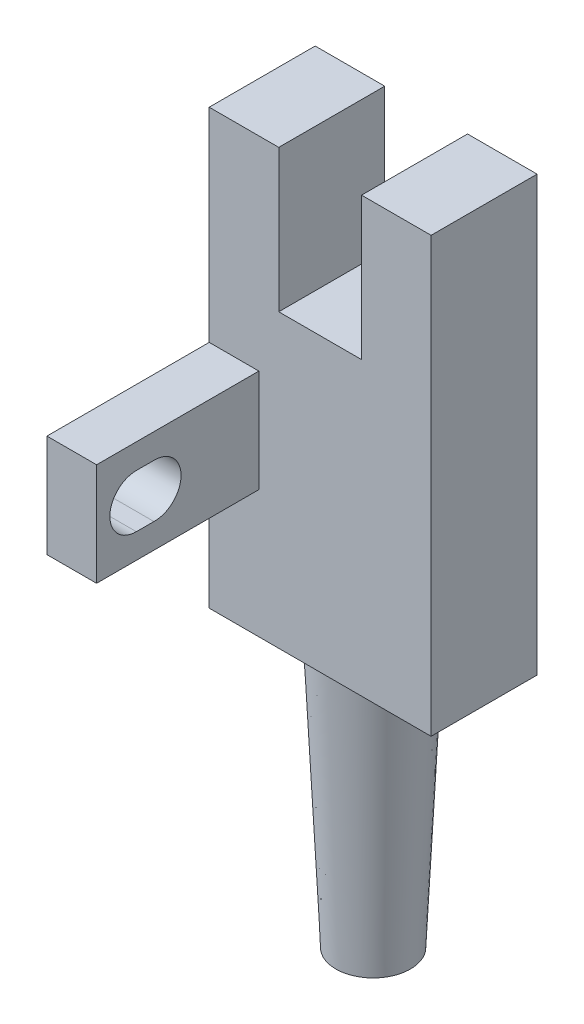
ISO-10303-21;
HEADER;
FILE_DESCRIPTION(('STEP AP214'),'2;1');
FILE_NAME('part.step','',(''),(''),'','','');
FILE_SCHEMA(('AUTOMOTIVE_DESIGN { 1 0 10303 214 1 1 1 1 }'));
ENDSEC;
DATA;
#1=APPLICATION_CONTEXT('core data for automotive mechanical design processes');
#2=APPLICATION_PROTOCOL_DEFINITION('international standard','automotive_design',2000,#1);
#3=PRODUCT_CONTEXT('',#1,'mechanical');
#4=PRODUCT('Part','Part','',(#3));
#5=PRODUCT_RELATED_PRODUCT_CATEGORY('part','',(#4));
#6=PRODUCT_DEFINITION_FORMATION('','',#4);
#7=PRODUCT_DEFINITION_CONTEXT('part definition',#1,'design');
#8=PRODUCT_DEFINITION('design','',#6,#7);
#9=PRODUCT_DEFINITION_SHAPE('','',#8);
#10=(LENGTH_UNIT() NAMED_UNIT(*) SI_UNIT(.MILLI.,.METRE.));
#11=(NAMED_UNIT(*) PLANE_ANGLE_UNIT() SI_UNIT($,.RADIAN.));
#12=(NAMED_UNIT(*) SI_UNIT($,.STERADIAN.) SOLID_ANGLE_UNIT());
#13=UNCERTAINTY_MEASURE_WITH_UNIT(LENGTH_MEASURE(1.E-05),#10,'distance_accuracy_value','');
#14=(GEOMETRIC_REPRESENTATION_CONTEXT(3) GLOBAL_UNCERTAINTY_ASSIGNED_CONTEXT((#13)) GLOBAL_UNIT_ASSIGNED_CONTEXT((#10,
#11,#12)) REPRESENTATION_CONTEXT('',''));
#15=CARTESIAN_POINT('',(0.,0.,0.));
#16=DIRECTION('',(0.,0.,1.));
#17=DIRECTION('',(1.,0.,0.));
#18=AXIS2_PLACEMENT_3D('',#15,#16,#17);
#19=CARTESIAN_POINT('',(60.923,6.200412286,141.22262812));
#20=DIRECTION('',(0.,1.,0.));
#21=DIRECTION('',(0.,0.,1.));
#22=AXIS2_PLACEMENT_3D('',#19,#20,#21);
#23=PLANE('',#22);
#24=CARTESIAN_POINT('',(63.2,6.20041228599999,143.49962812));
#25=DIRECTION('',(0.,1.,0.));
#26=DIRECTION('',(-1.,0.,0.));
#27=AXIS2_PLACEMENT_3D('',#24,#25,#26);
#28=CIRCLE('',#27,2.24999999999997);
#29=CARTESIAN_POINT('',(60.95,6.20041228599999,143.49962812));
#30=VERTEX_POINT('',#29);
#31=EDGE_CURVE('E21',#30,#30,#28,.F.);
#32=ORIENTED_EDGE('',*,*,#31,.T.);
#33=EDGE_LOOP('',(#32));
#34=FACE_BOUND('',#33,.T.);
#35=ADVANCED_FACE('F17',(#34),#23,.F.);
#36=CARTESIAN_POINT('',(63.2,6.200412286,143.49962812));
#37=DIRECTION('',(0.,1.,0.));
#38=DIRECTION('',(-1.,0.,0.));
#39=AXIS2_PLACEMENT_3D('',#36,#37,#38);
#40=CONICAL_SURFACE('',#39,2.24999999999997,0.0468407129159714);
#41=ORIENTED_EDGE('',*,*,#31,.F.);
#42=EDGE_LOOP('',(#41));
#43=FACE_BOUND('',#42,.T.);
#44=CARTESIAN_POINT('',(63.2,22.2004122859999,143.49962812));
#45=DIRECTION('',(0.,1.,0.));
#46=DIRECTION('',(-1.,0.,0.));
#47=AXIS2_PLACEMENT_3D('',#44,#45,#46);
#48=CIRCLE('',#47,3.);
#49=CARTESIAN_POINT('',(60.2,22.2004122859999,143.49962812));
#50=VERTEX_POINT('',#49);
#51=EDGE_CURVE('E205',#50,#50,#48,.F.);
#52=ORIENTED_EDGE('',*,*,#51,.T.);
#53=EDGE_LOOP('',(#52));
#54=FACE_BOUND('',#53,.T.);
#55=ADVANCED_FACE('F523',(#43,#54),#40,.T.);
#56=CARTESIAN_POINT('',(56.5,31.400412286,153.036320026));
#57=DIRECTION('',(0.,1.,0.));
#58=DIRECTION('',(0.,0.,1.));
#59=AXIS2_PLACEMENT_3D('',#56,#57,#58);
#60=PLANE('',#59);
#61=DIRECTION('',(-1.,0.,0.));
#62=VECTOR('',#61,1.);
#63=CARTESIAN_POINT('',(58.,31.4004122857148,153.036320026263));
#64=LINE('',#63,#62);
#65=CARTESIAN_POINT('',(56.5,31.4004122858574,153.036320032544));
#66=VERTEX_POINT('',#65);
#67=CARTESIAN_POINT('',(59.5,31.4004122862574,153.03632005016));
#68=VERTEX_POINT('',#67);
#69=EDGE_CURVE('E86',#66,#68,#64,.F.);
#70=ORIENTED_EDGE('',*,*,#69,.F.);
#71=DIRECTION('',(0.,0.,1.));
#72=VECTOR('',#71,1.);
#73=CARTESIAN_POINT('',(56.5,31.400412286,153.567974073));
#74=LINE('',#73,#72);
#75=CARTESIAN_POINT('',(56.5,31.400412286,154.099628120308));
#76=VERTEX_POINT('',#75);
#77=EDGE_CURVE('E179',#66,#76,#74,.T.);
#78=ORIENTED_EDGE('',*,*,#77,.T.);
#79=DIRECTION('',(1.,0.,0.));
#80=VECTOR('',#79,1.);
#81=CARTESIAN_POINT('',(58.,31.400412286,154.099628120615));
#82=LINE('',#81,#80);
#83=CARTESIAN_POINT('',(59.5,31.4004122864,154.099628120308));
#84=VERTEX_POINT('',#83);
#85=EDGE_CURVE('E204',#84,#76,#82,.F.);
#86=ORIENTED_EDGE('',*,*,#85,.F.);
#87=DIRECTION('',(0.,0.,1.));
#88=VECTOR('',#87,1.);
#89=CARTESIAN_POINT('',(59.5,31.4004122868,151.59962812));
#90=LINE('',#89,#88);
#91=EDGE_CURVE('E173',#68,#84,#90,.T.);
#92=ORIENTED_EDGE('',*,*,#91,.F.);
#93=EDGE_LOOP('',(#70,#78,#86,#92));
#94=FACE_BOUND('',#93,.T.);
#95=ADVANCED_FACE('F346',(#94),#60,.T.);
#96=CARTESIAN_POINT('',(56.5,34.6,153.));
#97=DIRECTION('',(0.,1.,0.));
#98=DIRECTION('',(0.,0.,1.));
#99=AXIS2_PLACEMENT_3D('',#96,#97,#98);
#100=PLANE('',#99);
#101=DIRECTION('',(1.,0.,0.));
#102=VECTOR('',#101,1.);
#103=CARTESIAN_POINT('',(58.,34.6,153.000000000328));
#104=LINE('',#103,#102);
#105=CARTESIAN_POINT('',(59.5,34.5999999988,153.000000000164));
#106=VERTEX_POINT('',#105);
#107=CARTESIAN_POINT('',(56.5,34.6,153.000000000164));
#108=VERTEX_POINT('',#107);
#109=EDGE_CURVE('E207',#106,#108,#104,.F.);
#110=ORIENTED_EDGE('',*,*,#109,.F.);
#111=DIRECTION('',(0.,0.,-1.));
#112=VECTOR('',#111,1.);
#113=CARTESIAN_POINT('',(59.5,34.5999999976,151.59962812));
#114=LINE('',#113,#112);
#115=CARTESIAN_POINT('',(59.5,34.5999999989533,154.063308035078));
#116=VERTEX_POINT('',#115);
#117=EDGE_CURVE('E175',#116,#106,#114,.T.);
#118=ORIENTED_EDGE('',*,*,#117,.F.);
#119=DIRECTION('',(-1.,0.,0.));
#120=VECTOR('',#119,1.);
#121=CARTESIAN_POINT('',(58.,34.6000000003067,154.06330809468));
#122=LINE('',#121,#120);
#123=CARTESIAN_POINT('',(56.5,34.6000000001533,154.063308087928));
#124=VERTEX_POINT('',#123);
#125=EDGE_CURVE('E203',#124,#116,#122,.F.);
#126=ORIENTED_EDGE('',*,*,#125,.F.);
#127=DIRECTION('',(0.,0.,1.));
#128=VECTOR('',#127,1.);
#129=CARTESIAN_POINT('',(56.5,34.6,153.531654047));
#130=LINE('',#129,#128);
#131=EDGE_CURVE('E177',#108,#124,#130,.T.);
#132=ORIENTED_EDGE('',*,*,#131,.F.);
#133=EDGE_LOOP('',(#110,#118,#126,#132));
#134=FACE_BOUND('',#133,.T.);
#135=ADVANCED_FACE('F343',(#134),#100,.F.);
#136=CARTESIAN_POINT('',(59.5,29.900412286,156.49962812));
#137=DIRECTION('',(1.,0.,0.));
#138=DIRECTION('',(0.,0.,-1.));
#139=AXIS2_PLACEMENT_3D('',#136,#137,#138);
#140=PLANE('',#139);
#141=CARTESIAN_POINT('',(59.5,33.,153.));
#142=DIRECTION('',(1.,0.,0.));
#143=DIRECTION('',(0.,0.,-1.));
#144=AXIS2_PLACEMENT_3D('',#141,#142,#143);
#145=CIRCLE('',#144,1.59999999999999);
#146=EDGE_CURVE('E91',#68,#106,#145,.T.);
#147=ORIENTED_EDGE('',*,*,#146,.F.);
#148=ORIENTED_EDGE('',*,*,#91,.T.);
#149=CARTESIAN_POINT('',(59.5,33.000412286,154.09962812));
#150=DIRECTION('',(1.,0.,0.));
#151=DIRECTION('',(0.,0.,-1.));
#152=AXIS2_PLACEMENT_3D('',#149,#150,#151);
#153=CIRCLE('',#152,1.59999999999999);
#154=EDGE_CURVE('E199',#116,#84,#153,.T.);
#155=ORIENTED_EDGE('',*,*,#154,.F.);
#156=ORIENTED_EDGE('',*,*,#117,.T.);
#157=EDGE_LOOP('',(#147,#148,#155,#156));
#158=FACE_BOUND('',#157,.T.);
#159=DIRECTION('',(0.,0.,-1.));
#160=VECTOR('',#159,1.);
#161=CARTESIAN_POINT('',(59.5,29.900412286,151.59962812));
#162=LINE('',#161,#160);
#163=CARTESIAN_POINT('',(59.5,29.900412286,156.49962812));
#164=VERTEX_POINT('',#163);
#165=CARTESIAN_POINT('',(59.49999999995,29.9004122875,146.69962812));
#166=VERTEX_POINT('',#165);
#167=EDGE_CURVE('E239',#164,#166,#162,.T.);
#168=ORIENTED_EDGE('',*,*,#167,.T.);
#169=DIRECTION('',(0.,-1.,0.));
#170=VECTOR('',#169,1.);
#171=CARTESIAN_POINT('',(59.4999999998,35.300412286,146.69962812));
#172=LINE('',#171,#170);
#173=CARTESIAN_POINT('',(59.49999999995,36.10041228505,146.69962812));
#174=VERTEX_POINT('',#173);
#175=EDGE_CURVE('E134',#174,#166,#172,.T.);
#176=ORIENTED_EDGE('',*,*,#175,.F.);
#177=DIRECTION('',(0.,0.,-1.));
#178=VECTOR('',#177,1.);
#179=CARTESIAN_POINT('',(59.5,36.100412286,151.59962812));
#180=LINE('',#179,#178);
#181=CARTESIAN_POINT('',(59.5,36.100412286,156.49962812));
#182=VERTEX_POINT('',#181);
#183=EDGE_CURVE('E132',#182,#174,#180,.T.);
#184=ORIENTED_EDGE('',*,*,#183,.F.);
#185=DIRECTION('',(0.,1.,0.));
#186=VECTOR('',#185,1.);
#187=CARTESIAN_POINT('',(59.5,33.000412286,156.49962812));
#188=LINE('',#187,#186);
#189=EDGE_CURVE('E129',#164,#182,#188,.T.);
#190=ORIENTED_EDGE('',*,*,#189,.F.);
#191=EDGE_LOOP('',(#168,#176,#184,#190));
#192=FACE_BOUND('',#191,.T.);
#193=ADVANCED_FACE('F133',(#158,#192),#140,.T.);
#194=CARTESIAN_POINT('',(69.9,22.200412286,146.69962812));
#195=DIRECTION('',(1.,0.,0.));
#196=DIRECTION('',(0.,0.,-1.));
#197=AXIS2_PLACEMENT_3D('',#194,#195,#196);
#198=PLANE('',#197);
#199=DIRECTION('',(0.,1.,0.));
#200=VECTOR('',#199,1.);
#201=CARTESIAN_POINT('',(69.9,35.300412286,140.29962812));
#202=LINE('',#201,#200);
#203=CARTESIAN_POINT('',(69.9,22.200412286,140.29962812));
#204=VERTEX_POINT('',#203);
#205=CARTESIAN_POINT('',(69.9,48.400412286,140.29962812));
#206=VERTEX_POINT('',#205);
#207=EDGE_CURVE('E315',#204,#206,#202,.T.);
#208=ORIENTED_EDGE('',*,*,#207,.T.);
#209=DIRECTION('',(0.,0.,-1.));
#210=VECTOR('',#209,1.);
#211=CARTESIAN_POINT('',(69.9,48.400412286,143.49962812));
#212=LINE('',#211,#210);
#213=CARTESIAN_POINT('',(69.9,48.400412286,146.69962812));
#214=VERTEX_POINT('',#213);
#215=EDGE_CURVE('E170',#214,#206,#212,.T.);
#216=ORIENTED_EDGE('',*,*,#215,.F.);
#217=DIRECTION('',(0.,1.,0.));
#218=VECTOR('',#217,1.);
#219=CARTESIAN_POINT('',(69.9,35.300412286,146.69962812));
#220=LINE('',#219,#218);
#221=CARTESIAN_POINT('',(69.9,22.200412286,146.69962812));
#222=VERTEX_POINT('',#221);
#223=EDGE_CURVE('E100',#222,#214,#220,.T.);
#224=ORIENTED_EDGE('',*,*,#223,.F.);
#225=DIRECTION('',(0.,0.,-1.));
#226=VECTOR('',#225,1.);
#227=CARTESIAN_POINT('',(69.9,22.200412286,143.49962812));
#228=LINE('',#227,#226);
#229=EDGE_CURVE('E208',#222,#204,#228,.T.);
#230=ORIENTED_EDGE('',*,*,#229,.T.);
#231=EDGE_LOOP('',(#208,#216,#224,#230));
#232=FACE_BOUND('',#231,.T.);
#233=ADVANCED_FACE('F413',(#232),#198,.T.);
#234=CARTESIAN_POINT('',(65.7,48.400412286,140.29962812));
#235=DIRECTION('',(0.,1.,0.));
#236=DIRECTION('',(0.,0.,1.));
#237=AXIS2_PLACEMENT_3D('',#234,#235,#236);
#238=PLANE('',#237);
#239=DIRECTION('',(-1.,0.,0.));
#240=VECTOR('',#239,1.);
#241=CARTESIAN_POINT('',(63.2,48.400412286,140.29962812));
#242=LINE('',#241,#240);
#243=CARTESIAN_POINT('',(65.6999999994,48.400412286,140.29962812));
#244=VERTEX_POINT('',#243);
#245=EDGE_CURVE('E312',#206,#244,#242,.T.);
#246=ORIENTED_EDGE('',*,*,#245,.T.);
#247=DIRECTION('',(0.,0.,1.));
#248=VECTOR('',#247,1.);
#249=CARTESIAN_POINT('',(65.7,48.400412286,143.49962812));
#250=LINE('',#249,#248);
#251=CARTESIAN_POINT('',(65.6999999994,48.400412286,146.69962812));
#252=VERTEX_POINT('',#251);
#253=EDGE_CURVE('E167',#244,#252,#250,.T.);
#254=ORIENTED_EDGE('',*,*,#253,.T.);
#255=DIRECTION('',(-1.,0.,0.));
#256=VECTOR('',#255,1.);
#257=CARTESIAN_POINT('',(63.2,48.400412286,146.69962812));
#258=LINE('',#257,#256);
#259=EDGE_CURVE('E227',#214,#252,#258,.T.);
#260=ORIENTED_EDGE('',*,*,#259,.F.);
#261=ORIENTED_EDGE('',*,*,#215,.T.);
#262=EDGE_LOOP('',(#246,#254,#260,#261));
#263=FACE_BOUND('',#262,.T.);
#264=ADVANCED_FACE('F417',(#263),#238,.T.);
#265=CARTESIAN_POINT('',(65.7,39.800412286,146.69962812));
#266=DIRECTION('',(1.,0.,0.));
#267=DIRECTION('',(0.,0.,-1.));
#268=AXIS2_PLACEMENT_3D('',#265,#266,#267);
#269=PLANE('',#268);
#270=DIRECTION('',(0.,-1.,0.));
#271=VECTOR('',#270,1.);
#272=CARTESIAN_POINT('',(65.6999999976,35.300412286,146.69962812));
#273=LINE('',#272,#271);
#274=CARTESIAN_POINT('',(65.6999999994,39.80041228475,146.69962812));
#275=VERTEX_POINT('',#274);
#276=EDGE_CURVE('E225',#252,#275,#273,.T.);
#277=ORIENTED_EDGE('',*,*,#276,.F.);
#278=ORIENTED_EDGE('',*,*,#253,.F.);
#279=DIRECTION('',(0.,-1.,0.));
#280=VECTOR('',#279,1.);
#281=CARTESIAN_POINT('',(65.6999999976,35.300412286,140.29962812));
#282=LINE('',#281,#280);
#283=CARTESIAN_POINT('',(65.6999999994,39.80041228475,140.29962812));
#284=VERTEX_POINT('',#283);
#285=EDGE_CURVE('E309',#244,#284,#282,.T.);
#286=ORIENTED_EDGE('',*,*,#285,.T.);
#287=DIRECTION('',(0.,0.,-1.));
#288=VECTOR('',#287,1.);
#289=CARTESIAN_POINT('',(65.7,39.800412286,143.49962812));
#290=LINE('',#289,#288);
#291=EDGE_CURVE('E164',#275,#284,#290,.T.);
#292=ORIENTED_EDGE('',*,*,#291,.F.);
#293=EDGE_LOOP('',(#277,#278,#286,#292));
#294=FACE_BOUND('',#293,.T.);
#295=ADVANCED_FACE('F424',(#294),#269,.F.);
#296=CARTESIAN_POINT('',(60.7,39.800412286,140.29962812));
#297=DIRECTION('',(0.,1.,0.));
#298=DIRECTION('',(0.,0.,1.));
#299=AXIS2_PLACEMENT_3D('',#296,#297,#298);
#300=PLANE('',#299);
#301=DIRECTION('',(-1.,0.,0.));
#302=VECTOR('',#301,1.);
#303=CARTESIAN_POINT('',(63.2,39.800412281,140.29962812));
#304=LINE('',#303,#302);
#305=CARTESIAN_POINT('',(60.7000000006,39.80041228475,140.29962812));
#306=VERTEX_POINT('',#305);
#307=EDGE_CURVE('E306',#284,#306,#304,.T.);
#308=ORIENTED_EDGE('',*,*,#307,.T.);
#309=DIRECTION('',(0.,0.,-1.));
#310=VECTOR('',#309,1.);
#311=CARTESIAN_POINT('',(60.7,39.800412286,143.49962812));
#312=LINE('',#311,#310);
#313=CARTESIAN_POINT('',(60.7000000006,39.80041228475,146.69962812));
#314=VERTEX_POINT('',#313);
#315=EDGE_CURVE('E161',#314,#306,#312,.T.);
#316=ORIENTED_EDGE('',*,*,#315,.F.);
#317=DIRECTION('',(-1.,0.,0.));
#318=VECTOR('',#317,1.);
#319=CARTESIAN_POINT('',(63.2,39.800412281,146.69962812));
#320=LINE('',#319,#318);
#321=EDGE_CURVE('E223',#275,#314,#320,.T.);
#322=ORIENTED_EDGE('',*,*,#321,.F.);
#323=ORIENTED_EDGE('',*,*,#291,.T.);
#324=EDGE_LOOP('',(#308,#316,#322,#323));
#325=FACE_BOUND('',#324,.T.);
#326=ADVANCED_FACE('F430',(#325),#300,.T.);
#327=CARTESIAN_POINT('',(60.7,39.800412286,146.69962812));
#328=DIRECTION('',(1.,0.,0.));
#329=DIRECTION('',(0.,0.,-1.));
#330=AXIS2_PLACEMENT_3D('',#327,#328,#329);
#331=PLANE('',#330);
#332=DIRECTION('',(0.,1.,0.));
#333=VECTOR('',#332,1.);
#334=CARTESIAN_POINT('',(60.7000000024,35.300412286,140.29962812));
#335=LINE('',#334,#333);
#336=CARTESIAN_POINT('',(60.7000000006,48.400412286,140.29962812));
#337=VERTEX_POINT('',#336);
#338=EDGE_CURVE('E303',#306,#337,#335,.T.);
#339=ORIENTED_EDGE('',*,*,#338,.T.);
#340=DIRECTION('',(0.,0.,-1.));
#341=VECTOR('',#340,1.);
#342=CARTESIAN_POINT('',(60.7,48.400412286,143.49962812));
#343=LINE('',#342,#341);
#344=CARTESIAN_POINT('',(60.7000000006,48.400412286,146.69962812));
#345=VERTEX_POINT('',#344);
#346=EDGE_CURVE('E140',#345,#337,#343,.T.);
#347=ORIENTED_EDGE('',*,*,#346,.F.);
#348=DIRECTION('',(0.,1.,0.));
#349=VECTOR('',#348,1.);
#350=CARTESIAN_POINT('',(60.7000000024,35.300412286,146.69962812));
#351=LINE('',#350,#349);
#352=EDGE_CURVE('E217',#314,#345,#351,.T.);
#353=ORIENTED_EDGE('',*,*,#352,.F.);
#354=ORIENTED_EDGE('',*,*,#315,.T.);
#355=EDGE_LOOP('',(#339,#347,#353,#354));
#356=FACE_BOUND('',#355,.T.);
#357=ADVANCED_FACE('F435',(#356),#331,.T.);
#358=CARTESIAN_POINT('',(56.5,48.400412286,140.29962812));
#359=DIRECTION('',(0.,1.,0.));
#360=DIRECTION('',(0.,0.,1.));
#361=AXIS2_PLACEMENT_3D('',#358,#359,#360);
#362=PLANE('',#361);
#363=DIRECTION('',(0.,0.,1.));
#364=VECTOR('',#363,1.);
#365=CARTESIAN_POINT('',(56.5,48.400412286,143.49962812));
#366=LINE('',#365,#364);
#367=CARTESIAN_POINT('',(56.5,48.400412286,140.2996281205));
#368=VERTEX_POINT('',#367);
#369=CARTESIAN_POINT('',(56.5,48.400412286,146.6996281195));
#370=VERTEX_POINT('',#369);
#371=EDGE_CURVE('E273',#368,#370,#366,.T.);
#372=ORIENTED_EDGE('',*,*,#371,.T.);
#373=DIRECTION('',(-1.,0.,0.));
#374=VECTOR('',#373,1.);
#375=CARTESIAN_POINT('',(63.2,48.400412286,146.69962812));
#376=LINE('',#375,#374);
#377=EDGE_CURVE('E236',#345,#370,#376,.T.);
#378=ORIENTED_EDGE('',*,*,#377,.F.);
#379=ORIENTED_EDGE('',*,*,#346,.T.);
#380=DIRECTION('',(-1.,0.,0.));
#381=VECTOR('',#380,1.);
#382=CARTESIAN_POINT('',(63.2,48.400412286,140.29962812));
#383=LINE('',#382,#381);
#384=EDGE_CURVE('E300',#337,#368,#383,.T.);
#385=ORIENTED_EDGE('',*,*,#384,.T.);
#386=EDGE_LOOP('',(#372,#378,#379,#385));
#387=FACE_BOUND('',#386,.T.);
#388=ADVANCED_FACE('F438',(#387),#362,.T.);
#389=CARTESIAN_POINT('',(56.5,36.100412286,146.69962812));
#390=DIRECTION('',(0.,1.,0.));
#391=DIRECTION('',(0.,0.,1.));
#392=AXIS2_PLACEMENT_3D('',#389,#390,#391);
#393=PLANE('',#392);
#394=DIRECTION('',(-1.,0.,0.));
#395=VECTOR('',#394,1.);
#396=CARTESIAN_POINT('',(58.,36.100412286,156.49962812));
#397=LINE('',#396,#395);
#398=CARTESIAN_POINT('',(56.5,36.10041228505,156.49962812));
#399=VERTEX_POINT('',#398);
#400=EDGE_CURVE('E139',#182,#399,#397,.T.);
#401=ORIENTED_EDGE('',*,*,#400,.F.);
#402=ORIENTED_EDGE('',*,*,#183,.T.);
#403=DIRECTION('',(1.,0.,0.));
#404=VECTOR('',#403,1.);
#405=CARTESIAN_POINT('',(63.2,36.1004122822,146.69962812));
#406=LINE('',#405,#404);
#407=CARTESIAN_POINT('',(56.5,36.10041228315,146.6996281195));
#408=VERTEX_POINT('',#407);
#409=EDGE_CURVE('E234',#408,#174,#406,.T.);
#410=ORIENTED_EDGE('',*,*,#409,.F.);
#411=DIRECTION('',(0.,0.,1.));
#412=VECTOR('',#411,1.);
#413=CARTESIAN_POINT('',(56.5,36.1004122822,143.49962812));
#414=LINE('',#413,#412);
#415=EDGE_CURVE('E155',#408,#399,#414,.T.);
#416=ORIENTED_EDGE('',*,*,#415,.T.);
#417=EDGE_LOOP('',(#401,#402,#410,#416));
#418=FACE_BOUND('',#417,.T.);
#419=ADVANCED_FACE('F153',(#418),#393,.T.);
#420=CARTESIAN_POINT('',(56.5,29.900412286,156.49962812));
#421=DIRECTION('',(0.,0.,1.));
#422=DIRECTION('',(1.,0.,0.));
#423=AXIS2_PLACEMENT_3D('',#420,#421,#422);
#424=PLANE('',#423);
#425=DIRECTION('',(1.,0.,0.));
#426=VECTOR('',#425,1.);
#427=CARTESIAN_POINT('',(58.,29.900412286,156.49962812));
#428=LINE('',#427,#426);
#429=CARTESIAN_POINT('',(56.5,29.9004122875,156.49962812));
#430=VERTEX_POINT('',#429);
#431=EDGE_CURVE('E150',#430,#164,#428,.T.);
#432=ORIENTED_EDGE('',*,*,#431,.T.);
#433=ORIENTED_EDGE('',*,*,#189,.T.);
#434=ORIENTED_EDGE('',*,*,#400,.T.);
#435=DIRECTION('',(0.,-1.,0.));
#436=VECTOR('',#435,1.);
#437=CARTESIAN_POINT('',(56.5,35.300412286,156.49962812));
#438=LINE('',#437,#436);
#439=EDGE_CURVE('E264',#399,#430,#438,.T.);
#440=ORIENTED_EDGE('',*,*,#439,.T.);
#441=EDGE_LOOP('',(#432,#433,#434,#440));
#442=FACE_BOUND('',#441,.T.);
#443=ADVANCED_FACE('F145',(#442),#424,.T.);
#444=CARTESIAN_POINT('',(56.5,29.900412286,146.69962812));
#445=DIRECTION('',(0.,1.,0.));
#446=DIRECTION('',(0.,0.,1.));
#447=AXIS2_PLACEMENT_3D('',#444,#445,#446);
#448=PLANE('',#447);
#449=ORIENTED_EDGE('',*,*,#431,.F.);
#450=DIRECTION('',(0.,0.,-1.));
#451=VECTOR('',#450,1.);
#452=CARTESIAN_POINT('',(56.5,29.900412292,143.49962812));
#453=LINE('',#452,#451);
#454=CARTESIAN_POINT('',(56.5,29.900412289,146.6996281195));
#455=VERTEX_POINT('',#454);
#456=EDGE_CURVE('E246',#430,#455,#453,.T.);
#457=ORIENTED_EDGE('',*,*,#456,.T.);
#458=DIRECTION('',(-1.,0.,0.));
#459=VECTOR('',#458,1.);
#460=CARTESIAN_POINT('',(63.2,29.900412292,146.69962812));
#461=LINE('',#460,#459);
#462=EDGE_CURVE('E230',#166,#455,#461,.T.);
#463=ORIENTED_EDGE('',*,*,#462,.F.);
#464=ORIENTED_EDGE('',*,*,#167,.F.);
#465=EDGE_LOOP('',(#449,#457,#463,#464));
#466=FACE_BOUND('',#465,.T.);
#467=ADVANCED_FACE('F243',(#466),#448,.F.);
#468=CARTESIAN_POINT('',(56.5,22.200412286,146.69962812));
#469=DIRECTION('',(0.,0.,1.));
#470=DIRECTION('',(1.,0.,0.));
#471=AXIS2_PLACEMENT_3D('',#468,#469,#470);
#472=PLANE('',#471);
#473=ORIENTED_EDGE('',*,*,#321,.T.);
#474=ORIENTED_EDGE('',*,*,#352,.T.);
#475=ORIENTED_EDGE('',*,*,#377,.T.);
#476=DIRECTION('',(0.,-1.,0.));
#477=VECTOR('',#476,1.);
#478=CARTESIAN_POINT('',(56.5,35.300412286,146.699628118));
#479=LINE('',#478,#477);
#480=EDGE_CURVE('E270',#370,#408,#479,.T.);
#481=ORIENTED_EDGE('',*,*,#480,.T.);
#482=ORIENTED_EDGE('',*,*,#409,.T.);
#483=ORIENTED_EDGE('',*,*,#175,.T.);
#484=ORIENTED_EDGE('',*,*,#462,.T.);
#485=DIRECTION('',(0.,-1.,0.));
#486=VECTOR('',#485,1.);
#487=CARTESIAN_POINT('',(56.5,35.300412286,146.699628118));
#488=LINE('',#487,#486);
#489=CARTESIAN_POINT('',(56.5,22.200412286,146.6996281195));
#490=VERTEX_POINT('',#489);
#491=EDGE_CURVE('E252',#455,#490,#488,.T.);
#492=ORIENTED_EDGE('',*,*,#491,.T.);
#493=DIRECTION('',(1.,0.,0.));
#494=VECTOR('',#493,1.);
#495=CARTESIAN_POINT('',(63.2,22.200412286,146.69962812));
#496=LINE('',#495,#494);
#497=EDGE_CURVE('E212',#490,#222,#496,.T.);
#498=ORIENTED_EDGE('',*,*,#497,.T.);
#499=ORIENTED_EDGE('',*,*,#223,.T.);
#500=ORIENTED_EDGE('',*,*,#259,.T.);
#501=ORIENTED_EDGE('',*,*,#276,.T.);
#502=EDGE_LOOP('',(#473,#474,#475,#481,#482,#483,#484,#492,#498,#499,#500,#501));
#503=FACE_BOUND('',#502,.T.);
#504=ADVANCED_FACE('F250',(#503),#472,.T.);
#505=CARTESIAN_POINT('',(56.5,22.200412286,140.29962812));
#506=DIRECTION('',(0.,1.,0.));
#507=DIRECTION('',(0.,0.,1.));
#508=AXIS2_PLACEMENT_3D('',#505,#506,#507);
#509=PLANE('',#508);
#510=ORIENTED_EDGE('',*,*,#51,.F.);
#511=EDGE_LOOP('',(#510));
#512=FACE_BOUND('',#511,.T.);
#513=ORIENTED_EDGE('',*,*,#497,.F.);
#514=DIRECTION('',(0.,0.,-1.));
#515=VECTOR('',#514,1.);
#516=CARTESIAN_POINT('',(56.5,22.200412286,143.49962812));
#517=LINE('',#516,#515);
#518=CARTESIAN_POINT('',(56.5,22.200412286,140.2996281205));
#519=VERTEX_POINT('',#518);
#520=EDGE_CURVE('E260',#490,#519,#517,.T.);
#521=ORIENTED_EDGE('',*,*,#520,.T.);
#522=DIRECTION('',(1.,0.,0.));
#523=VECTOR('',#522,1.);
#524=CARTESIAN_POINT('',(63.2,22.200412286,140.29962812));
#525=LINE('',#524,#523);
#526=EDGE_CURVE('E317',#519,#204,#525,.T.);
#527=ORIENTED_EDGE('',*,*,#526,.T.);
#528=ORIENTED_EDGE('',*,*,#229,.F.);
#529=EDGE_LOOP('',(#513,#521,#527,#528));
#530=FACE_BOUND('',#529,.T.);
#531=ADVANCED_FACE('F351',(#512,#530),#509,.F.);
#532=CARTESIAN_POINT('',(56.5,33.,153.));
#533=DIRECTION('',(1.,0.,0.));
#534=DIRECTION('',(0.,0.,-1.));
#535=AXIS2_PLACEMENT_3D('',#532,#533,#534);
#536=CYLINDRICAL_SURFACE('',#535,1.59999999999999);
#537=ORIENTED_EDGE('',*,*,#69,.T.);
#538=ORIENTED_EDGE('',*,*,#146,.T.);
#539=ORIENTED_EDGE('',*,*,#109,.T.);
#540=CARTESIAN_POINT('',(56.5,33.,153.));
#541=DIRECTION('',(1.,0.,0.));
#542=DIRECTION('',(0.,0.,-1.));
#543=AXIS2_PLACEMENT_3D('',#540,#541,#542);
#544=CIRCLE('',#543,1.59999999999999);
#545=EDGE_CURVE('E193',#108,#66,#544,.F.);
#546=ORIENTED_EDGE('',*,*,#545,.T.);
#547=EDGE_LOOP('',(#537,#538,#539,#546));
#548=FACE_BOUND('',#547,.T.);
#549=ADVANCED_FACE('F349',(#548),#536,.F.);
#550=CARTESIAN_POINT('',(56.5,33.000412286,154.09962812));
#551=DIRECTION('',(1.,0.,0.));
#552=DIRECTION('',(0.,0.,-1.));
#553=AXIS2_PLACEMENT_3D('',#550,#551,#552);
#554=CYLINDRICAL_SURFACE('',#553,1.59999999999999);
#555=ORIENTED_EDGE('',*,*,#125,.T.);
#556=ORIENTED_EDGE('',*,*,#154,.T.);
#557=ORIENTED_EDGE('',*,*,#85,.T.);
#558=CARTESIAN_POINT('',(56.5,33.000412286,154.09962812));
#559=DIRECTION('',(1.,0.,0.));
#560=DIRECTION('',(0.,0.,-1.));
#561=AXIS2_PLACEMENT_3D('',#558,#559,#560);
#562=CIRCLE('',#561,1.59999999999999);
#563=EDGE_CURVE('E189',#76,#124,#562,.F.);
#564=ORIENTED_EDGE('',*,*,#563,.T.);
#565=EDGE_LOOP('',(#555,#556,#557,#564));
#566=FACE_BOUND('',#565,.T.);
#567=ADVANCED_FACE('F336',(#566),#554,.F.);
#568=CARTESIAN_POINT('',(56.5,31.400412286,132.89962812));
#569=DIRECTION('',(0.,1.,0.));
#570=DIRECTION('',(0.,0.,1.));
#571=AXIS2_PLACEMENT_3D('',#568,#569,#570);
#572=PLANE('',#571);
#573=DIRECTION('',(-1.,0.,0.));
#574=VECTOR('',#573,1.);
#575=CARTESIAN_POINT('',(58.,31.400412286,132.899628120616));
#576=LINE('',#575,#574);
#577=CARTESIAN_POINT('',(56.5,31.4004122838,132.899628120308));
#578=VERTEX_POINT('',#577);
#579=CARTESIAN_POINT('',(59.5,31.400412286,132.899628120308));
#580=VERTEX_POINT('',#579);
#581=EDGE_CURVE('E192',#578,#580,#576,.F.);
#582=ORIENTED_EDGE('',*,*,#581,.F.);
#583=DIRECTION('',(0.,0.,1.));
#584=VECTOR('',#583,1.);
#585=CARTESIAN_POINT('',(56.5,31.4004122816,143.49962812));
#586=LINE('',#585,#584);
#587=CARTESIAN_POINT('',(56.5,31.4004122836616,133.962936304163));
#588=VERTEX_POINT('',#587);
#589=EDGE_CURVE('E198',#578,#588,#586,.T.);
#590=ORIENTED_EDGE('',*,*,#589,.T.);
#591=DIRECTION('',(1.,0.,0.));
#592=VECTOR('',#591,1.);
#593=CARTESIAN_POINT('',(58.,31.4004122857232,133.962936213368));
#594=LINE('',#593,#592);
#595=CARTESIAN_POINT('',(59.5,31.4004122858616,133.962936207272));
#596=VERTEX_POINT('',#595);
#597=EDGE_CURVE('E288',#596,#588,#594,.F.);
#598=ORIENTED_EDGE('',*,*,#597,.F.);
#599=DIRECTION('',(0.,0.,-1.));
#600=VECTOR('',#599,1.);
#601=CARTESIAN_POINT('',(59.5,31.400412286,133.431282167));
#602=LINE('',#601,#600);
#603=EDGE_CURVE('E202',#596,#580,#602,.T.);
#604=ORIENTED_EDGE('',*,*,#603,.T.);
#605=EDGE_LOOP('',(#582,#590,#598,#604));
#606=FACE_BOUND('',#605,.T.);
#607=ADVANCED_FACE('F358',(#606),#572,.T.);
#608=CARTESIAN_POINT('',(56.5,29.900412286,130.49962812));
#609=DIRECTION('',(0.,1.,0.));
#610=DIRECTION('',(0.,0.,1.));
#611=AXIS2_PLACEMENT_3D('',#608,#609,#610);
#612=PLANE('',#611);
#613=DIRECTION('',(-1.,0.,0.));
#614=VECTOR('',#613,1.);
#615=CARTESIAN_POINT('',(63.2,29.900412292,140.29962812));
#616=LINE('',#615,#614);
#617=CARTESIAN_POINT('',(59.49999999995,29.9004122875,140.29962812));
#618=VERTEX_POINT('',#617);
#619=CARTESIAN_POINT('',(56.5,29.900412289,140.2996281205));
#620=VERTEX_POINT('',#619);
#621=EDGE_CURVE('E320',#618,#620,#616,.T.);
#622=ORIENTED_EDGE('',*,*,#621,.T.);
#623=DIRECTION('',(0.,0.,-1.));
#624=VECTOR('',#623,1.);
#625=CARTESIAN_POINT('',(56.5,29.900412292,143.49962812));
#626=LINE('',#625,#624);
#627=CARTESIAN_POINT('',(56.5,29.9004122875,130.49962812));
#628=VERTEX_POINT('',#627);
#629=EDGE_CURVE('E285',#620,#628,#626,.T.);
#630=ORIENTED_EDGE('',*,*,#629,.T.);
#631=DIRECTION('',(1.,0.,0.));
#632=VECTOR('',#631,1.);
#633=CARTESIAN_POINT('',(58.,29.900412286,130.49962812));
#634=LINE('',#633,#632);
#635=CARTESIAN_POINT('',(59.5,29.900412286,130.49962812));
#636=VERTEX_POINT('',#635);
#637=EDGE_CURVE('E326',#628,#636,#634,.T.);
#638=ORIENTED_EDGE('',*,*,#637,.T.);
#639=DIRECTION('',(0.,0.,-1.));
#640=VECTOR('',#639,1.);
#641=CARTESIAN_POINT('',(59.5,29.900412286,135.39962812));
#642=LINE('',#641,#640);
#643=EDGE_CURVE('E295',#618,#636,#642,.T.);
#644=ORIENTED_EDGE('',*,*,#643,.F.);
#645=EDGE_LOOP('',(#622,#630,#638,#644));
#646=FACE_BOUND('',#645,.T.);
#647=ADVANCED_FACE('F481',(#646),#612,.F.);
#648=CARTESIAN_POINT('',(56.5,29.900412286,130.49962812));
#649=DIRECTION('',(0.,0.,1.));
#650=DIRECTION('',(1.,0.,0.));
#651=AXIS2_PLACEMENT_3D('',#648,#649,#650);
#652=PLANE('',#651);
#653=ORIENTED_EDGE('',*,*,#637,.F.);
#654=DIRECTION('',(0.,1.,0.));
#655=VECTOR('',#654,1.);
#656=CARTESIAN_POINT('',(56.5,35.300412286,130.49962812));
#657=LINE('',#656,#655);
#658=CARTESIAN_POINT('',(56.5,36.10041228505,130.49962812));
#659=VERTEX_POINT('',#658);
#660=EDGE_CURVE('E282',#628,#659,#657,.T.);
#661=ORIENTED_EDGE('',*,*,#660,.T.);
#662=DIRECTION('',(-1.,0.,0.));
#663=VECTOR('',#662,1.);
#664=CARTESIAN_POINT('',(58.,36.100412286,130.49962812));
#665=LINE('',#664,#663);
#666=CARTESIAN_POINT('',(59.5,36.100412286,130.49962812));
#667=VERTEX_POINT('',#666);
#668=EDGE_CURVE('E323',#667,#659,#665,.T.);
#669=ORIENTED_EDGE('',*,*,#668,.F.);
#670=DIRECTION('',(0.,1.,0.));
#671=VECTOR('',#670,1.);
#672=CARTESIAN_POINT('',(59.5,33.000412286,130.49962812));
#673=LINE('',#672,#671);
#674=EDGE_CURVE('E463',#636,#667,#673,.T.);
#675=ORIENTED_EDGE('',*,*,#674,.F.);
#676=EDGE_LOOP('',(#653,#661,#669,#675));
#677=FACE_BOUND('',#676,.T.);
#678=ADVANCED_FACE('F460',(#677),#652,.F.);
#679=CARTESIAN_POINT('',(56.5,36.100412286,130.49962812));
#680=DIRECTION('',(0.,1.,0.));
#681=DIRECTION('',(0.,0.,1.));
#682=AXIS2_PLACEMENT_3D('',#679,#680,#681);
#683=PLANE('',#682);
#684=DIRECTION('',(1.,0.,0.));
#685=VECTOR('',#684,1.);
#686=CARTESIAN_POINT('',(63.2,36.1004122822,140.29962812));
#687=LINE('',#686,#685);
#688=CARTESIAN_POINT('',(56.5,36.1004122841,140.2996281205));
#689=VERTEX_POINT('',#688);
#690=CARTESIAN_POINT('',(59.49999999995,36.10041228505,140.29962812));
#691=VERTEX_POINT('',#690);
#692=EDGE_CURVE('E297',#689,#691,#687,.T.);
#693=ORIENTED_EDGE('',*,*,#692,.T.);
#694=DIRECTION('',(0.,0.,1.));
#695=VECTOR('',#694,1.);
#696=CARTESIAN_POINT('',(59.5,36.100412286,135.39962812));
#697=LINE('',#696,#695);
#698=EDGE_CURVE('E455',#667,#691,#697,.T.);
#699=ORIENTED_EDGE('',*,*,#698,.F.);
#700=ORIENTED_EDGE('',*,*,#668,.T.);
#701=DIRECTION('',(0.,0.,1.));
#702=VECTOR('',#701,1.);
#703=CARTESIAN_POINT('',(56.5,36.1004122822,143.49962812));
#704=LINE('',#703,#702);
#705=EDGE_CURVE('E279',#659,#689,#704,.T.);
#706=ORIENTED_EDGE('',*,*,#705,.T.);
#707=EDGE_LOOP('',(#693,#699,#700,#706));
#708=FACE_BOUND('',#707,.T.);
#709=ADVANCED_FACE('F381',(#708),#683,.T.);
#710=CARTESIAN_POINT('',(56.5,22.200412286,140.29962812));
#711=DIRECTION('',(0.,0.,1.));
#712=DIRECTION('',(1.,0.,0.));
#713=AXIS2_PLACEMENT_3D('',#710,#711,#712);
#714=PLANE('',#713);
#715=ORIENTED_EDGE('',*,*,#692,.F.);
#716=DIRECTION('',(0.,1.,0.));
#717=VECTOR('',#716,1.);
#718=CARTESIAN_POINT('',(56.5,35.300412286,140.299628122));
#719=LINE('',#718,#717);
#720=EDGE_CURVE('E276',#689,#368,#719,.T.);
#721=ORIENTED_EDGE('',*,*,#720,.T.);
#722=ORIENTED_EDGE('',*,*,#384,.F.);
#723=ORIENTED_EDGE('',*,*,#338,.F.);
#724=ORIENTED_EDGE('',*,*,#307,.F.);
#725=ORIENTED_EDGE('',*,*,#285,.F.);
#726=ORIENTED_EDGE('',*,*,#245,.F.);
#727=ORIENTED_EDGE('',*,*,#207,.F.);
#728=ORIENTED_EDGE('',*,*,#526,.F.);
#729=DIRECTION('',(0.,1.,0.));
#730=VECTOR('',#729,1.);
#731=CARTESIAN_POINT('',(56.5,35.300412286,140.299628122));
#732=LINE('',#731,#730);
#733=EDGE_CURVE('E262',#519,#620,#732,.T.);
#734=ORIENTED_EDGE('',*,*,#733,.T.);
#735=ORIENTED_EDGE('',*,*,#621,.F.);
#736=DIRECTION('',(0.,-1.,0.));
#737=VECTOR('',#736,1.);
#738=CARTESIAN_POINT('',(59.5,33.000412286,140.29962812));
#739=LINE('',#738,#737);
#740=EDGE_CURVE('E188',#691,#618,#739,.T.);
#741=ORIENTED_EDGE('',*,*,#740,.F.);
#742=EDGE_LOOP('',(#715,#721,#722,#723,#724,#725,#726,#727,#728,#734,#735,#741));
#743=FACE_BOUND('',#742,.T.);
#744=ADVANCED_FACE('F374',(#743),#714,.F.);
#745=CARTESIAN_POINT('',(56.5,33.,133.99925624));
#746=DIRECTION('',(1.,0.,0.));
#747=DIRECTION('',(0.,0.,-1.));
#748=AXIS2_PLACEMENT_3D('',#745,#746,#747);
#749=CYLINDRICAL_SURFACE('',#748,1.59999999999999);
#750=CARTESIAN_POINT('',(59.5,33.,133.99925624));
#751=DIRECTION('',(1.,0.,0.));
#752=DIRECTION('',(0.,0.,-1.));
#753=AXIS2_PLACEMENT_3D('',#750,#751,#752);
#754=CIRCLE('',#753,1.59999999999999);
#755=CARTESIAN_POINT('',(59.5,34.6,133.99925624));
#756=VERTEX_POINT('',#755);
#757=EDGE_CURVE('E185',#596,#756,#754,.F.);
#758=ORIENTED_EDGE('',*,*,#757,.F.);
#759=ORIENTED_EDGE('',*,*,#597,.T.);
#760=CARTESIAN_POINT('',(56.5,33.,133.99925624));
#761=DIRECTION('',(1.,0.,0.));
#762=DIRECTION('',(0.,0.,-1.));
#763=AXIS2_PLACEMENT_3D('',#760,#761,#762);
#764=CIRCLE('',#763,1.59999999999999);
#765=CARTESIAN_POINT('',(56.5,34.6,133.99925624));
#766=VERTEX_POINT('',#765);
#767=EDGE_CURVE('E195',#588,#766,#764,.F.);
#768=ORIENTED_EDGE('',*,*,#767,.T.);
#769=DIRECTION('',(1.,0.,0.));
#770=VECTOR('',#769,1.);
#771=CARTESIAN_POINT('',(58.,34.6,133.99925624));
#772=LINE('',#771,#770);
#773=EDGE_CURVE('E187',#766,#756,#772,.T.);
#774=ORIENTED_EDGE('',*,*,#773,.T.);
#775=EDGE_LOOP('',(#758,#759,#768,#774));
#776=FACE_BOUND('',#775,.T.);
#777=ADVANCED_FACE('F372',(#776),#749,.F.);
#778=CARTESIAN_POINT('',(56.5,22.200412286,156.49962812));
#779=DIRECTION('',(1.,0.,0.));
#780=DIRECTION('',(0.,0.,-1.));
#781=AXIS2_PLACEMENT_3D('',#778,#779,#780);
#782=PLANE('',#781);
#783=ORIENTED_EDGE('',*,*,#77,.F.);
#784=ORIENTED_EDGE('',*,*,#545,.F.);
#785=ORIENTED_EDGE('',*,*,#131,.T.);
#786=ORIENTED_EDGE('',*,*,#563,.F.);
#787=EDGE_LOOP('',(#783,#784,#785,#786));
#788=FACE_BOUND('',#787,.T.);
#789=ORIENTED_EDGE('',*,*,#589,.F.);
#790=CARTESIAN_POINT('',(56.5,33.000412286,132.89962812));
#791=DIRECTION('',(1.,0.,0.));
#792=DIRECTION('',(0.,0.,-1.));
#793=AXIS2_PLACEMENT_3D('',#790,#791,#792);
#794=CIRCLE('',#793,1.60000000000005);
#795=CARTESIAN_POINT('',(56.5,34.6000000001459,132.935948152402));
#796=VERTEX_POINT('',#795);
#797=EDGE_CURVE('E182',#796,#578,#794,.F.);
#798=ORIENTED_EDGE('',*,*,#797,.F.);
#799=DIRECTION('',(0.,0.,1.));
#800=VECTOR('',#799,1.);
#801=CARTESIAN_POINT('',(56.5,34.6,133.467602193));
#802=LINE('',#801,#800);
#803=EDGE_CURVE('E184',#796,#766,#802,.T.);
#804=ORIENTED_EDGE('',*,*,#803,.T.);
#805=ORIENTED_EDGE('',*,*,#767,.F.);
#806=EDGE_LOOP('',(#789,#798,#804,#805));
#807=FACE_BOUND('',#806,.T.);
#808=ORIENTED_EDGE('',*,*,#520,.F.);
#809=ORIENTED_EDGE('',*,*,#491,.F.);
#810=ORIENTED_EDGE('',*,*,#456,.F.);
#811=ORIENTED_EDGE('',*,*,#439,.F.);
#812=ORIENTED_EDGE('',*,*,#415,.F.);
#813=ORIENTED_EDGE('',*,*,#480,.F.);
#814=ORIENTED_EDGE('',*,*,#371,.F.);
#815=ORIENTED_EDGE('',*,*,#720,.F.);
#816=ORIENTED_EDGE('',*,*,#705,.F.);
#817=ORIENTED_EDGE('',*,*,#660,.F.);
#818=ORIENTED_EDGE('',*,*,#629,.F.);
#819=ORIENTED_EDGE('',*,*,#733,.F.);
#820=EDGE_LOOP('',(#808,#809,#810,#811,#812,#813,#814,#815,#816,#817,#818,#819));
#821=FACE_BOUND('',#820,.T.);
#822=ADVANCED_FACE('F257',(#788,#807,#821),#782,.F.);
#823=CARTESIAN_POINT('',(59.5,29.900412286,140.29962812));
#824=DIRECTION('',(1.,0.,0.));
#825=DIRECTION('',(0.,0.,-1.));
#826=AXIS2_PLACEMENT_3D('',#823,#824,#825);
#827=PLANE('',#826);
#828=CARTESIAN_POINT('',(59.5,33.000412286,132.89962812));
#829=DIRECTION('',(1.,0.,0.));
#830=DIRECTION('',(0.,0.,-1.));
#831=AXIS2_PLACEMENT_3D('',#828,#829,#830);
#832=CIRCLE('',#831,1.60000000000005);
#833=CARTESIAN_POINT('',(59.5,34.6000000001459,132.935948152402));
#834=VERTEX_POINT('',#833);
#835=EDGE_CURVE('E27',#580,#834,#832,.T.);
#836=ORIENTED_EDGE('',*,*,#835,.F.);
#837=ORIENTED_EDGE('',*,*,#603,.F.);
#838=ORIENTED_EDGE('',*,*,#757,.T.);
#839=DIRECTION('',(0.,0.,-1.));
#840=VECTOR('',#839,1.);
#841=CARTESIAN_POINT('',(59.5,34.6,133.467602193));
#842=LINE('',#841,#840);
#843=EDGE_CURVE('E291',#756,#834,#842,.T.);
#844=ORIENTED_EDGE('',*,*,#843,.T.);
#845=EDGE_LOOP('',(#836,#837,#838,#844));
#846=FACE_BOUND('',#845,.T.);
#847=ORIENTED_EDGE('',*,*,#698,.T.);
#848=ORIENTED_EDGE('',*,*,#740,.T.);
#849=ORIENTED_EDGE('',*,*,#643,.T.);
#850=ORIENTED_EDGE('',*,*,#674,.T.);
#851=EDGE_LOOP('',(#847,#848,#849,#850));
#852=FACE_BOUND('',#851,.T.);
#853=ADVANCED_FACE('F369',(#846,#852),#827,.T.);
#854=CARTESIAN_POINT('',(56.5,34.6,132.935948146));
#855=DIRECTION('',(0.,1.,0.));
#856=DIRECTION('',(0.,0.,1.));
#857=AXIS2_PLACEMENT_3D('',#854,#855,#856);
#858=PLANE('',#857);
#859=DIRECTION('',(1.,0.,0.));
#860=VECTOR('',#859,1.);
#861=CARTESIAN_POINT('',(58.,34.6000000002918,132.935948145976));
#862=LINE('',#861,#860);
#863=EDGE_CURVE('E11',#834,#796,#862,.F.);
#864=ORIENTED_EDGE('',*,*,#863,.F.);
#865=ORIENTED_EDGE('',*,*,#843,.F.);
#866=ORIENTED_EDGE('',*,*,#773,.F.);
#867=ORIENTED_EDGE('',*,*,#803,.F.);
#868=EDGE_LOOP('',(#864,#865,#866,#867));
#869=FACE_BOUND('',#868,.T.);
#870=ADVANCED_FACE('F19',(#869),#858,.F.);
#871=CARTESIAN_POINT('',(56.5,33.000412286,132.89962812));
#872=DIRECTION('',(1.,0.,0.));
#873=DIRECTION('',(0.,0.,-1.));
#874=AXIS2_PLACEMENT_3D('',#871,#872,#873);
#875=CYLINDRICAL_SURFACE('',#874,1.60000000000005);
#876=ORIENTED_EDGE('',*,*,#835,.T.);
#877=ORIENTED_EDGE('',*,*,#863,.T.);
#878=ORIENTED_EDGE('',*,*,#797,.T.);
#879=ORIENTED_EDGE('',*,*,#581,.T.);
#880=EDGE_LOOP('',(#876,#877,#878,#879));
#881=FACE_BOUND('',#880,.T.);
#882=ADVANCED_FACE('F363',(#881),#875,.F.);
#883=CLOSED_SHELL('',(#35,#55,#95,#135,#193,#233,#264,#295,#326,#357,#388,#419,#443,#467,#504,
#531,#549,#567,#607,#647,#678,#709,#744,#777,#822,#853,#870,#882));
#884=MANIFOLD_SOLID_BREP('B1',#883);
#885=ADVANCED_BREP_SHAPE_REPRESENTATION('',(#18,#884),#14);
#886=SHAPE_DEFINITION_REPRESENTATION(#9,#885);
ENDSEC;
END-ISO-10303-21;
